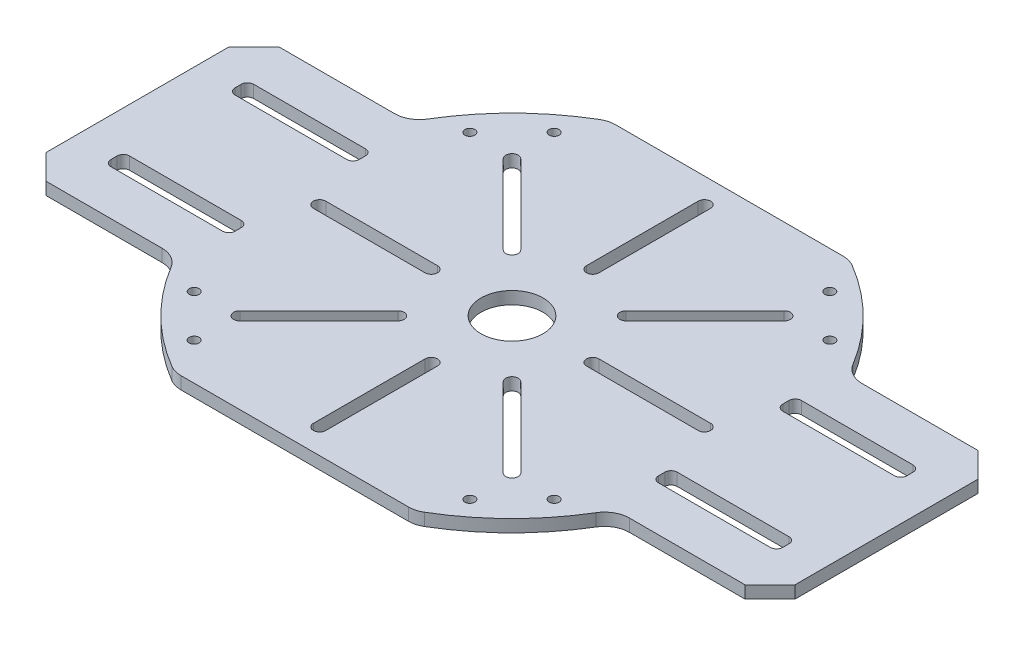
from build123d import *

# Parameters (mm, degrees)
SKETCH1_R           = 6.35
SKETCH1_R_2         = 1.016
SKETCH1_R_3         = 0.080960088
BOSS_EXTRUDE1_DEPTH = 2.54
CUT_EXTRUDE1_DEPTH  = 2.54
CUT_EXTRUDE2_DEPTH  = 2.54


with BuildPart() as part:
    # Sketch1 → Boss-Extrude1 (new body)
    with BuildSketch(Plane(origin=(0, 0, 0), x_dir=(1, 0, 0), z_dir=(0, 1, 0))):
        with BuildLine():
            Line((-23.244816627, 44.45), (23.244816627, 44.45))
            ThreePointArc((23.244816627, 44.45), (24.583514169, 44.270437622), (25.827574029, 43.744444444))
            ThreePointArc((25.827574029, 43.744444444), (35.740062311, 36.101079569), (43.482663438, 26.265909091))
            ThreePointArc((43.482663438, 26.265909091), (45.334600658, 24.468164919), (47.830929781, 23.8125))
            Line((47.830929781, 23.8125), (71.516875, 23.8125))
            Line((71.516875, 23.8125), (76.596875, 18.7325))
            Line((76.596875, 18.7325), (76.596875, -18.7325))
            Line((76.596875, -18.7325), (71.516875, -23.8125))
            Line((71.516875, -23.8125), (47.830929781, -23.8125))
            ThreePointArc((47.830929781, -23.8125), (45.334600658, -24.468164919), (43.482663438, -26.265909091))
            ThreePointArc((43.482663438, -26.265909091), (35.740062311, -36.101079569), (25.827574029, -43.744444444))
            ThreePointArc((25.827574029, -43.744444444), (24.583514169, -44.270437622), (23.244816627, -44.45))
            Line((23.244816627, -44.45), (-23.244816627, -44.45))
            ThreePointArc((-23.244816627, -44.45), (-24.583514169, -44.270437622), (-25.827574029, -43.744444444))
            ThreePointArc((-25.827574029, -43.744444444), (-35.740062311, -36.101079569), (-43.482663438, -26.265909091))
            ThreePointArc((-43.482663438, -26.265909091), (-45.334600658, -24.468164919), (-47.830929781, -23.8125))
            Line((-47.830929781, -23.8125), (-71.516875, -23.8125))
            Line((-71.516875, -23.8125), (-76.596875, -18.7325))
            Line((-76.596875, -18.7325), (-76.596875, 18.7325))
            Line((-76.596875, 18.7325), (-71.516875, 23.8125))
            Line((-71.516875, 23.8125), (-47.830929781, 23.8125))
            ThreePointArc((-47.830929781, 23.8125), (-45.334600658, 24.468164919), (-43.482663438, 26.265909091))
            ThreePointArc((-43.482663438, 26.265909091), (-35.740062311, 36.101079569), (-25.827574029, 43.744444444))
            ThreePointArc((-25.827574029, 43.744444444), (-24.583514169, 44.270437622), (-23.244816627, 44.45))
        make_face()
        with Locations(Location((0, 0, 0), (0, 0, 270))):
            Circle(SKETCH1_R, mode=Mode.SUBTRACT)
        with Locations(Location((36.819050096, 28.19800422, 0), (0, 0, 270))):
            Circle(SKETCH1_R_2, mode=Mode.SUBTRACT)
        with Locations(Location((28.19800422, 36.819050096, 0), (0, 0, 90))):
            Circle(SKETCH1_R_2, mode=Mode.SUBTRACT)
        with Locations(Location((26.671582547, 26.671582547, 0), (0, 0, 270))):
            Circle(SKETCH1_R_3, mode=Mode.SUBTRACT)
        with Locations(Location((26.671582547, -26.671582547, 0), (0, 0, 270))):
            Circle(SKETCH1_R_3, mode=Mode.SUBTRACT)
        with Locations(Location((36.819050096, -28.19800422, 0), (0, 0, 90))):
            Circle(SKETCH1_R_2, mode=Mode.SUBTRACT)
        with Locations(Location((28.19800422, -36.819050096, 0), (0, 0, 270))):
            Circle(SKETCH1_R_2, mode=Mode.SUBTRACT)
        with Locations(Location((-26.671582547, -26.671582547, 0), (0, 0, 270))):
            Circle(SKETCH1_R_3, mode=Mode.SUBTRACT)
        with Locations(Location((-28.19800422, -36.819050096, 0), (0, 0, 90))):
            Circle(SKETCH1_R_2, mode=Mode.SUBTRACT)
        with Locations(Location((-36.819050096, -28.19800422, 0), (0, 0, 270))):
            Circle(SKETCH1_R_2, mode=Mode.SUBTRACT)
        with Locations(Location((-26.671582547, 26.671582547, 0), (0, 0, 270))):
            Circle(SKETCH1_R_3, mode=Mode.SUBTRACT)
        with Locations(Location((-36.819050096, 28.19800422, 0), (0, 0, 90))):
            Circle(SKETCH1_R_2, mode=Mode.SUBTRACT)
        with Locations(Location((-28.19800422, 36.819050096, 0), (0, 0, 270))):
            Circle(SKETCH1_R_2, mode=Mode.SUBTRACT)
    extrude(amount=BOSS_EXTRUDE1_DEPTH)

    # Sketch3 → Cut-Extrude1 (cut)
    with BuildSketch(Plane(origin=(0, 2.54, 0), x_dir=(1, 0, 0), z_dir=(0, 1, 0))):
        with BuildLine():
            Line((10.776307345, 12.572358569), (26.940768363, 28.736819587))
            ThreePointArc((26.940768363, 28.736819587), (28.736819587, 28.736819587), (28.736819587, 26.940768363))
            Line((28.736819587, 26.940768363), (12.572358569, 10.776307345))
            ThreePointArc((12.572358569, 10.776307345), (10.776307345, 10.776307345), (10.776307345, 12.572358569))
        make_face()
        with BuildLine():
            Line((16.51, -1.27), (39.37, -1.27))
            ThreePointArc((39.37, -1.27), (40.64, 0), (39.37, 1.27))
            Line((39.37, 1.27), (16.51, 1.27))
            ThreePointArc((16.51, 1.27), (15.24, 0), (16.51, -1.27))
        make_face()
        with BuildLine():
            Line((10.776307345, -12.572358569), (26.940768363, -28.736819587))
            ThreePointArc((26.940768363, -28.736819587), (28.736819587, -28.736819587), (28.736819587, -26.940768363))
            Line((28.736819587, -26.940768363), (12.572358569, -10.776307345))
            ThreePointArc((12.572358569, -10.776307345), (10.776307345, -10.776307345), (10.776307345, -12.572358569))
        make_face()
        with BuildLine():
            Line((-1.27, -16.51), (-1.27, -39.37))
            ThreePointArc((-1.27, -39.37), (0, -40.64), (1.27, -39.37))
            Line((1.27, -39.37), (1.27, -16.51))
            ThreePointArc((1.27, -16.51), (0, -15.24), (-1.27, -16.51))
        make_face()
        with BuildLine():
            Line((-12.572358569, -10.776307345), (-28.736819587, -26.940768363))
            ThreePointArc((-28.736819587, -26.940768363), (-28.736819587, -28.736819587), (-26.940768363, -28.736819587))
            Line((-26.940768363, -28.736819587), (-10.776307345, -12.572358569))
            ThreePointArc((-10.776307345, -12.572358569), (-10.776307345, -10.776307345), (-12.572358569, -10.776307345))
        make_face()
        with BuildLine():
            Line((-16.51, 1.27), (-39.37, 1.27))
            ThreePointArc((-39.37, 1.27), (-40.64, 0), (-39.37, -1.27))
            Line((-39.37, -1.27), (-16.51, -1.27))
            ThreePointArc((-16.51, -1.27), (-15.24, 0), (-16.51, 1.27))
        make_face()
        with BuildLine():
            Line((-10.776307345, 12.572358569), (-26.940768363, 28.736819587))
            ThreePointArc((-26.940768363, 28.736819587), (-28.736819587, 28.736819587), (-28.736819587, 26.940768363))
            Line((-28.736819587, 26.940768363), (-12.572358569, 10.776307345))
            ThreePointArc((-12.572358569, 10.776307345), (-10.776307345, 10.776307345), (-10.776307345, 12.572358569))
        make_face()
        with BuildLine():
            Line((1.27, 16.51), (1.27, 39.37))
            ThreePointArc((1.27, 39.37), (0, 40.64), (-1.27, 39.37))
            Line((-1.27, 39.37), (-1.27, 16.51))
            ThreePointArc((-1.27, 16.51), (0, 15.24), (1.27, 16.51))
        make_face()
    extrude(amount=-CUT_EXTRUDE1_DEPTH, mode=Mode.SUBTRACT)

    # Sketch4 → Cut-Extrude2 (cut)
    with BuildSketch(Plane(origin=(0, 2.54, 0), x_dir=(1, 0, 0), z_dir=(0, 1, 0))):
        with BuildLine():
            Line((44.592875, 14.605), (67.452875, 14.605))
            ThreePointArc((67.452875, 14.605), (68.350900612, 14.233025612), (68.722875, 13.335))
            Line((68.722875, 13.335), (68.722875, 12.065))
            ThreePointArc((68.722875, 12.065), (68.350900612, 11.166974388), (67.452875, 10.795))
            Line((67.452875, 10.795), (44.592875, 10.795))
            ThreePointArc((44.592875, 10.795), (43.694849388, 11.166974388), (43.322875, 12.065))
            Line((43.322875, 12.065), (43.322875, 13.335))
            ThreePointArc((43.322875, 13.335), (43.694849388, 14.233025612), (44.592875, 14.605))
        make_face()
        with BuildLine():
            Line((68.722875, -13.335), (68.722875, -12.065))
            ThreePointArc((68.722875, -12.065), (68.350900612, -11.166974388), (67.452875, -10.795))
            Line((67.452875, -10.795), (44.592875, -10.795))
            ThreePointArc((44.592875, -10.795), (43.694849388, -11.166974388), (43.322875, -12.065))
            Line((43.322875, -12.065), (43.322875, -13.335))
            ThreePointArc((43.322875, -13.335), (43.694849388, -14.233025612), (44.592875, -14.605))
            Line((44.592875, -14.605), (67.452875, -14.605))
            ThreePointArc((67.452875, -14.605), (68.350900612, -14.233025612), (68.722875, -13.335))
        make_face()
        with BuildLine():
            Line((-44.592875, -14.605), (-67.452875, -14.605))
            ThreePointArc((-67.452875, -14.605), (-68.350900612, -14.233025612), (-68.722875, -13.335))
            Line((-68.722875, -13.335), (-68.722875, -12.065))
            ThreePointArc((-68.722875, -12.065), (-68.350900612, -11.166974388), (-67.452875, -10.795))
            Line((-67.452875, -10.795), (-44.592875, -10.795))
            ThreePointArc((-44.592875, -10.795), (-43.694849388, -11.166974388), (-43.322875, -12.065))
            Line((-43.322875, -12.065), (-43.322875, -13.335))
            ThreePointArc((-43.322875, -13.335), (-43.694849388, -14.233025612), (-44.592875, -14.605))
        make_face()
        with BuildLine():
            Line((-68.722875, 13.335), (-68.722875, 12.065))
            ThreePointArc((-68.722875, 12.065), (-68.350900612, 11.166974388), (-67.452875, 10.795))
            Line((-67.452875, 10.795), (-44.592875, 10.795))
            ThreePointArc((-44.592875, 10.795), (-43.694849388, 11.166974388), (-43.322875, 12.065))
            Line((-43.322875, 12.065), (-43.322875, 13.335))
            ThreePointArc((-43.322875, 13.335), (-43.694849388, 14.233025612), (-44.592875, 14.605))
            Line((-44.592875, 14.605), (-67.452875, 14.605))
            ThreePointArc((-67.452875, 14.605), (-68.350900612, 14.233025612), (-68.722875, 13.335))
        make_face()
    extrude(amount=-CUT_EXTRUDE2_DEPTH, mode=Mode.SUBTRACT)


solid = part.part
